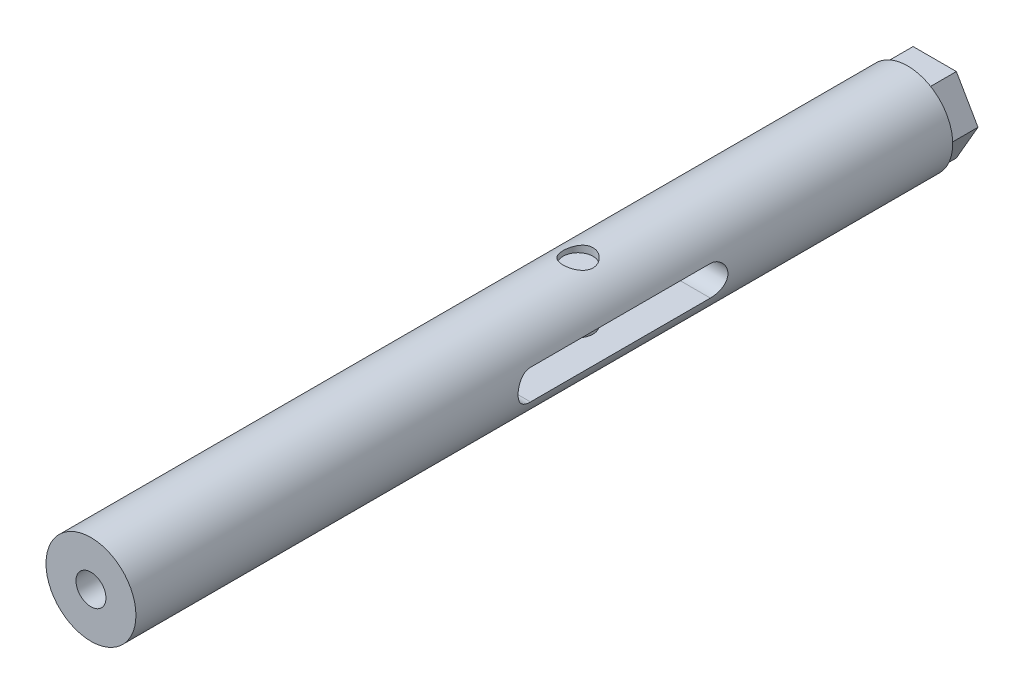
ISO-10303-21;
HEADER;
FILE_DESCRIPTION(('STEP AP214'),'2;1');
FILE_NAME('part.step','',(''),(''),'','','');
FILE_SCHEMA(('AUTOMOTIVE_DESIGN { 1 0 10303 214 1 1 1 1 }'));
ENDSEC;
DATA;
#1=APPLICATION_CONTEXT('core data for automotive mechanical design processes');
#2=APPLICATION_PROTOCOL_DEFINITION('international standard','automotive_design',2000,#1);
#3=PRODUCT_CONTEXT('',#1,'mechanical');
#4=PRODUCT('Part','Part','',(#3));
#5=PRODUCT_RELATED_PRODUCT_CATEGORY('part','',(#4));
#6=PRODUCT_DEFINITION_FORMATION('','',#4);
#7=PRODUCT_DEFINITION_CONTEXT('part definition',#1,'design');
#8=PRODUCT_DEFINITION('design','',#6,#7);
#9=PRODUCT_DEFINITION_SHAPE('','',#8);
#10=(LENGTH_UNIT() NAMED_UNIT(*) SI_UNIT(.MILLI.,.METRE.));
#11=(NAMED_UNIT(*) PLANE_ANGLE_UNIT() SI_UNIT($,.RADIAN.));
#12=(NAMED_UNIT(*) SI_UNIT($,.STERADIAN.) SOLID_ANGLE_UNIT());
#13=UNCERTAINTY_MEASURE_WITH_UNIT(LENGTH_MEASURE(1.E-05),#10,'distance_accuracy_value','');
#14=(GEOMETRIC_REPRESENTATION_CONTEXT(3) GLOBAL_UNCERTAINTY_ASSIGNED_CONTEXT((#13)) GLOBAL_UNIT_ASSIGNED_CONTEXT((#10,
#11,#12)) REPRESENTATION_CONTEXT('',''));
#15=CARTESIAN_POINT('',(0.,0.,0.));
#16=DIRECTION('',(0.,0.,1.));
#17=DIRECTION('',(1.,0.,0.));
#18=AXIS2_PLACEMENT_3D('',#15,#16,#17);
#19=CARTESIAN_POINT('',(0.,-5.,47.6));
#20=DIRECTION('',(0.,1.,0.));
#21=DIRECTION('',(-0.955367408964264,0.,-0.295420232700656));
#22=AXIS2_PLACEMENT_3D('',#19,#20,#21);
#23=PLANE('',#22);
#24=CARTESIAN_POINT('',(0.,-5.,47.6));
#25=DIRECTION('',(0.,1.,0.));
#26=DIRECTION('',(-0.955367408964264,0.,-0.295420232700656));
#27=AXIS2_PLACEMENT_3D('',#24,#25,#26);
#28=CIRCLE('',#27,2.);
#29=CARTESIAN_POINT('',(-1.91073481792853,-5.,47.0091595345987));
#30=VERTEX_POINT('',#29);
#31=EDGE_CURVE('E255',#30,#30,#28,.T.);
#32=ORIENTED_EDGE('',*,*,#31,.F.);
#33=EDGE_LOOP('',(#32));
#34=FACE_BOUND('',#33,.T.);
#35=ADVANCED_FACE('F14',(#34),#23,.F.);
#36=CARTESIAN_POINT('',(0.,5.,47.6));
#37=DIRECTION('',(0.,-1.,0.));
#38=DIRECTION('',(0.955367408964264,0.,0.295420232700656));
#39=AXIS2_PLACEMENT_3D('',#36,#37,#38);
#40=CYLINDRICAL_SURFACE('',#39,2.);
#41=CARTESIAN_POINT('',(0.,-2.,47.6));
#42=DIRECTION('',(0.,-1.,0.));
#43=DIRECTION('',(-1.,0.,0.));
#44=AXIS2_PLACEMENT_3D('',#41,#42,#43);
#45=CIRCLE('',#44,2.);
#46=CARTESIAN_POINT('',(-2.,-2.,47.6));
#47=VERTEX_POINT('',#46);
#48=EDGE_CURVE('E24',#47,#47,#45,.T.);
#49=ORIENTED_EDGE('',*,*,#48,.F.);
#50=EDGE_LOOP('',(#49));
#51=FACE_BOUND('',#50,.T.);
#52=CARTESIAN_POINT('',(0.,2.,47.6));
#53=DIRECTION('',(0.,1.,0.));
#54=DIRECTION('',(1.,0.,0.));
#55=AXIS2_PLACEMENT_3D('',#52,#53,#54);
#56=CIRCLE('',#55,2.);
#57=CARTESIAN_POINT('',(2.,2.,47.6));
#58=VERTEX_POINT('',#57);
#59=EDGE_CURVE('E9',#58,#58,#56,.T.);
#60=ORIENTED_EDGE('',*,*,#59,.F.);
#61=EDGE_LOOP('',(#60));
#62=FACE_BOUND('',#61,.T.);
#63=ADVANCED_FACE('F214',(#51,#62),#40,.T.);
#64=CARTESIAN_POINT('',(0.,5.,47.6));
#65=DIRECTION('',(0.,1.,0.));
#66=DIRECTION('',(-0.955367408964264,0.,-0.295420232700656));
#67=AXIS2_PLACEMENT_3D('',#64,#65,#66);
#68=PLANE('',#67);
#69=CARTESIAN_POINT('',(0.,5.,47.6));
#70=DIRECTION('',(0.,1.,0.));
#71=DIRECTION('',(-0.955367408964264,0.,-0.295420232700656));
#72=AXIS2_PLACEMENT_3D('',#69,#70,#71);
#73=CIRCLE('',#72,2.);
#74=CARTESIAN_POINT('',(-1.91073481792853,5.,47.0091595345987));
#75=VERTEX_POINT('',#74);
#76=EDGE_CURVE('E253',#75,#75,#73,.T.);
#77=ORIENTED_EDGE('',*,*,#76,.T.);
#78=EDGE_LOOP('',(#77));
#79=FACE_BOUND('',#78,.T.);
#80=ADVANCED_FACE('F217',(#79),#68,.T.);
#81=CARTESIAN_POINT('',(0.,0.,18.6));
#82=DIRECTION('',(0.,0.,-1.));
#83=DIRECTION('',(0.,1.,0.));
#84=AXIS2_PLACEMENT_3D('',#81,#82,#83);
#85=CONICAL_SURFACE('',#84,3.,1.02974425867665);
#86=CARTESIAN_POINT('',(0.,0.,20.4025818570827));
#87=VERTEX_POINT('',#86);
#88=VERTEX_LOOP('',#87);
#89=FACE_BOUND('',#88,.T.);
#90=CARTESIAN_POINT('',(0.,0.,18.6));
#91=DIRECTION('',(0.,0.,-1.));
#92=DIRECTION('',(0.,1.,0.));
#93=AXIS2_PLACEMENT_3D('',#90,#91,#92);
#94=CIRCLE('',#93,3.);
#95=CARTESIAN_POINT('',(0.,3.,18.6));
#96=VERTEX_POINT('',#95);
#97=EDGE_CURVE('E142',#96,#96,#94,.T.);
#98=ORIENTED_EDGE('',*,*,#97,.T.);
#99=EDGE_LOOP('',(#98));
#100=FACE_BOUND('',#99,.T.);
#101=ADVANCED_FACE('F194',(#89,#100),#85,.F.);
#102=CARTESIAN_POINT('',(0.,0.,3.6));
#103=DIRECTION('',(0.,0.,-1.));
#104=DIRECTION('',(0.,1.,0.));
#105=AXIS2_PLACEMENT_3D('',#102,#103,#104);
#106=CYLINDRICAL_SURFACE('',#105,3.);
#107=ORIENTED_EDGE('',*,*,#97,.F.);
#108=EDGE_LOOP('',(#107));
#109=FACE_BOUND('',#108,.T.);
#110=CARTESIAN_POINT('',(0.,0.,0.));
#111=DIRECTION('',(0.,0.,1.));
#112=DIRECTION('',(-0.5,-0.86602540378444,0.));
#113=AXIS2_PLACEMENT_3D('',#110,#111,#112);
#114=CIRCLE('',#113,3.);
#115=CARTESIAN_POINT('',(-1.5,-2.59807621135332,0.));
#116=VERTEX_POINT('',#115);
#117=EDGE_CURVE('E18',#116,#116,#114,.F.);
#118=ORIENTED_EDGE('',*,*,#117,.T.);
#119=EDGE_LOOP('',(#118));
#120=FACE_BOUND('',#119,.T.);
#121=ADVANCED_FACE('F231',(#109,#120),#106,.F.);
#122=CARTESIAN_POINT('',(-11.7435941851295,-0.340501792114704,0.));
#123=DIRECTION('',(0.,0.,1.));
#124=DIRECTION('',(-0.5,-0.86602540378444,0.));
#125=AXIS2_PLACEMENT_3D('',#122,#123,#124);
#126=PLANE('',#125);
#127=DIRECTION('',(-0.5,-0.86602540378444,0.));
#128=VECTOR('',#127,1.);
#129=CARTESIAN_POINT('',(2.88675134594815,-5.,0.));
#130=LINE('',#129,#128);
#131=CARTESIAN_POINT('',(5.77350269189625,0.,0.));
#132=VERTEX_POINT('',#131);
#133=CARTESIAN_POINT('',(2.88675134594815,-5.,0.));
#134=VERTEX_POINT('',#133);
#135=EDGE_CURVE('E54',#132,#134,#130,.T.);
#136=ORIENTED_EDGE('',*,*,#135,.T.);
#137=DIRECTION('',(1.,0.,0.));
#138=VECTOR('',#137,1.);
#139=CARTESIAN_POINT('',(2.88675134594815,-5.,0.));
#140=LINE('',#139,#138);
#141=CARTESIAN_POINT('',(-2.8867513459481,-5.,0.));
#142=VERTEX_POINT('',#141);
#143=EDGE_CURVE('E442',#142,#134,#140,.T.);
#144=ORIENTED_EDGE('',*,*,#143,.F.);
#145=DIRECTION('',(-0.5,0.866025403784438,0.));
#146=VECTOR('',#145,1.);
#147=CARTESIAN_POINT('',(-5.77350269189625,0.,0.));
#148=LINE('',#147,#146);
#149=CARTESIAN_POINT('',(-5.77350269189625,0.,0.));
#150=VERTEX_POINT('',#149);
#151=EDGE_CURVE('E444',#142,#150,#148,.T.);
#152=ORIENTED_EDGE('',*,*,#151,.T.);
#153=DIRECTION('',(-0.5,-0.86602540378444,0.));
#154=VECTOR('',#153,1.);
#155=CARTESIAN_POINT('',(-5.77350269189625,0.,0.));
#156=LINE('',#155,#154);
#157=CARTESIAN_POINT('',(-2.88675134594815,5.,0.));
#158=VERTEX_POINT('',#157);
#159=EDGE_CURVE('E445',#158,#150,#156,.T.);
#160=ORIENTED_EDGE('',*,*,#159,.F.);
#161=DIRECTION('',(-1.,0.,0.));
#162=VECTOR('',#161,1.);
#163=CARTESIAN_POINT('',(-2.88675134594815,5.,0.));
#164=LINE('',#163,#162);
#165=CARTESIAN_POINT('',(2.88675134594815,5.,0.));
#166=VERTEX_POINT('',#165);
#167=EDGE_CURVE('E59',#166,#158,#164,.T.);
#168=ORIENTED_EDGE('',*,*,#167,.F.);
#169=DIRECTION('',(0.5,-0.866025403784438,0.));
#170=VECTOR('',#169,1.);
#171=CARTESIAN_POINT('',(5.77350269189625,0.,0.));
#172=LINE('',#171,#170);
#173=EDGE_CURVE('E249',#166,#132,#172,.T.);
#174=ORIENTED_EDGE('',*,*,#173,.T.);
#175=EDGE_LOOP('',(#136,#144,#152,#160,#168,#174));
#176=FACE_BOUND('',#175,.T.);
#177=ORIENTED_EDGE('',*,*,#117,.F.);
#178=EDGE_LOOP('',(#177));
#179=FACE_BOUND('',#178,.T.);
#180=ADVANCED_FACE('F314',(#176,#179),#126,.F.);
#181=CARTESIAN_POINT('',(-5.77350269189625,0.,-1.4));
#182=DIRECTION('',(-0.866025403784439,-0.5,0.));
#183=DIRECTION('',(-0.5,0.866025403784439,0.));
#184=AXIS2_PLACEMENT_3D('',#181,#182,#183);
#185=PLANE('',#184);
#186=ORIENTED_EDGE('',*,*,#151,.F.);
#187=DIRECTION('',(0.,0.,1.));
#188=VECTOR('',#187,1.);
#189=CARTESIAN_POINT('',(-2.8867513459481,-5.,-1.4));
#190=LINE('',#189,#188);
#191=CARTESIAN_POINT('',(-2.8867513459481,-5.,3.6));
#192=VERTEX_POINT('',#191);
#193=EDGE_CURVE('E123',#142,#192,#190,.T.);
#194=ORIENTED_EDGE('',*,*,#193,.T.);
#195=DIRECTION('',(0.5,-0.866025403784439,0.));
#196=VECTOR('',#195,1.);
#197=CARTESIAN_POINT('',(-5.77350269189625,0.,3.6));
#198=LINE('',#197,#196);
#199=CARTESIAN_POINT('',(-5.77350269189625,0.,3.6));
#200=VERTEX_POINT('',#199);
#201=EDGE_CURVE('E118',#200,#192,#198,.T.);
#202=ORIENTED_EDGE('',*,*,#201,.F.);
#203=DIRECTION('',(0.,0.,1.));
#204=VECTOR('',#203,1.);
#205=CARTESIAN_POINT('',(-5.77350269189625,0.,-1.4));
#206=LINE('',#205,#204);
#207=EDGE_CURVE('E117',#150,#200,#206,.T.);
#208=ORIENTED_EDGE('',*,*,#207,.F.);
#209=EDGE_LOOP('',(#186,#194,#202,#208));
#210=FACE_BOUND('',#209,.T.);
#211=ADVANCED_FACE('F322',(#210),#185,.T.);
#212=CARTESIAN_POINT('',(-5.77350269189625,0.,-1.4));
#213=DIRECTION('',(0.86602540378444,-0.5,0.));
#214=DIRECTION('',(0.,0.,-1.));
#215=AXIS2_PLACEMENT_3D('',#212,#213,#214);
#216=PLANE('',#215);
#217=DIRECTION('',(0.,0.,1.));
#218=VECTOR('',#217,1.);
#219=CARTESIAN_POINT('',(-2.88675134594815,5.,-1.4));
#220=LINE('',#219,#218);
#221=CARTESIAN_POINT('',(-2.88675134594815,5.,3.6));
#222=VERTEX_POINT('',#221);
#223=EDGE_CURVE('E115',#158,#222,#220,.T.);
#224=ORIENTED_EDGE('',*,*,#223,.F.);
#225=ORIENTED_EDGE('',*,*,#159,.T.);
#226=ORIENTED_EDGE('',*,*,#207,.T.);
#227=DIRECTION('',(0.5,0.86602540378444,0.));
#228=VECTOR('',#227,1.);
#229=CARTESIAN_POINT('',(-5.77350269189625,0.,3.6));
#230=LINE('',#229,#228);
#231=EDGE_CURVE('E104',#200,#222,#230,.T.);
#232=ORIENTED_EDGE('',*,*,#231,.T.);
#233=EDGE_LOOP('',(#224,#225,#226,#232));
#234=FACE_BOUND('',#233,.T.);
#235=ADVANCED_FACE('F113',(#234),#216,.F.);
#236=CARTESIAN_POINT('',(-2.88675134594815,5.,-1.4));
#237=DIRECTION('',(0.,-1.,0.));
#238=DIRECTION('',(-1.,0.,0.));
#239=AXIS2_PLACEMENT_3D('',#236,#237,#238);
#240=PLANE('',#239);
#241=DIRECTION('',(0.,0.,1.));
#242=VECTOR('',#241,1.);
#243=CARTESIAN_POINT('',(2.88675134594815,5.,-1.4));
#244=LINE('',#243,#242);
#245=CARTESIAN_POINT('',(2.88675134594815,5.,3.6));
#246=VERTEX_POINT('',#245);
#247=EDGE_CURVE('E121',#166,#246,#244,.T.);
#248=ORIENTED_EDGE('',*,*,#247,.F.);
#249=ORIENTED_EDGE('',*,*,#167,.T.);
#250=ORIENTED_EDGE('',*,*,#223,.T.);
#251=DIRECTION('',(1.,0.,0.));
#252=VECTOR('',#251,1.);
#253=CARTESIAN_POINT('',(-2.88675134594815,5.,3.6));
#254=LINE('',#253,#252);
#255=EDGE_CURVE('E100',#222,#246,#254,.T.);
#256=ORIENTED_EDGE('',*,*,#255,.T.);
#257=EDGE_LOOP('',(#248,#249,#250,#256));
#258=FACE_BOUND('',#257,.T.);
#259=ADVANCED_FACE('F120',(#258),#240,.F.);
#260=CARTESIAN_POINT('',(5.77350269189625,0.,-1.4));
#261=DIRECTION('',(0.866025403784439,0.5,0.));
#262=DIRECTION('',(0.5,-0.866025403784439,0.));
#263=AXIS2_PLACEMENT_3D('',#260,#261,#262);
#264=PLANE('',#263);
#265=ORIENTED_EDGE('',*,*,#173,.F.);
#266=ORIENTED_EDGE('',*,*,#247,.T.);
#267=DIRECTION('',(-0.5,0.866025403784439,0.));
#268=VECTOR('',#267,1.);
#269=CARTESIAN_POINT('',(5.77350269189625,0.,3.6));
#270=LINE('',#269,#268);
#271=CARTESIAN_POINT('',(5.77350269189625,0.,3.6));
#272=VERTEX_POINT('',#271);
#273=EDGE_CURVE('E33',#272,#246,#270,.T.);
#274=ORIENTED_EDGE('',*,*,#273,.F.);
#275=DIRECTION('',(0.,0.,1.));
#276=VECTOR('',#275,1.);
#277=CARTESIAN_POINT('',(5.77350269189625,0.,-1.4));
#278=LINE('',#277,#276);
#279=EDGE_CURVE('E125',#132,#272,#278,.T.);
#280=ORIENTED_EDGE('',*,*,#279,.F.);
#281=EDGE_LOOP('',(#265,#266,#274,#280));
#282=FACE_BOUND('',#281,.T.);
#283=ADVANCED_FACE('F324',(#282),#264,.T.);
#284=CARTESIAN_POINT('',(2.88675134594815,-5.,-1.4));
#285=DIRECTION('',(0.86602540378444,-0.5,0.));
#286=DIRECTION('',(0.,0.,-1.));
#287=AXIS2_PLACEMENT_3D('',#284,#285,#286);
#288=PLANE('',#287);
#289=ORIENTED_EDGE('',*,*,#135,.F.);
#290=ORIENTED_EDGE('',*,*,#279,.T.);
#291=DIRECTION('',(0.5,0.86602540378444,0.));
#292=VECTOR('',#291,1.);
#293=CARTESIAN_POINT('',(2.88675134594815,-5.,3.6));
#294=LINE('',#293,#292);
#295=CARTESIAN_POINT('',(2.88675134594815,-5.,3.6));
#296=VERTEX_POINT('',#295);
#297=EDGE_CURVE('E257',#296,#272,#294,.T.);
#298=ORIENTED_EDGE('',*,*,#297,.F.);
#299=DIRECTION('',(0.,0.,1.));
#300=VECTOR('',#299,1.);
#301=CARTESIAN_POINT('',(2.88675134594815,-5.,-1.4));
#302=LINE('',#301,#300);
#303=EDGE_CURVE('E130',#134,#296,#302,.T.);
#304=ORIENTED_EDGE('',*,*,#303,.F.);
#305=EDGE_LOOP('',(#289,#290,#298,#304));
#306=FACE_BOUND('',#305,.T.);
#307=ADVANCED_FACE('F331',(#306),#288,.T.);
#308=CARTESIAN_POINT('',(2.88675134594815,-5.,-1.4));
#309=DIRECTION('',(0.,1.,0.));
#310=DIRECTION('',(1.,0.,0.));
#311=AXIS2_PLACEMENT_3D('',#308,#309,#310);
#312=PLANE('',#311);
#313=ORIENTED_EDGE('',*,*,#193,.F.);
#314=ORIENTED_EDGE('',*,*,#143,.T.);
#315=ORIENTED_EDGE('',*,*,#303,.T.);
#316=DIRECTION('',(-1.,0.,0.));
#317=VECTOR('',#316,1.);
#318=CARTESIAN_POINT('',(2.88675134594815,-5.,3.6));
#319=LINE('',#318,#317);
#320=EDGE_CURVE('E282',#296,#192,#319,.T.);
#321=ORIENTED_EDGE('',*,*,#320,.T.);
#322=EDGE_LOOP('',(#313,#314,#315,#321));
#323=FACE_BOUND('',#322,.T.);
#324=ADVANCED_FACE('F16',(#323),#312,.F.);
#325=CARTESIAN_POINT('',(0.,0.,3.6));
#326=DIRECTION('',(0.,0.,1.));
#327=DIRECTION('',(0.,-1.,0.));
#328=AXIS2_PLACEMENT_3D('',#325,#326,#327);
#329=PLANE('',#328);
#330=ORIENTED_EDGE('',*,*,#320,.F.);
#331=ORIENTED_EDGE('',*,*,#297,.T.);
#332=ORIENTED_EDGE('',*,*,#273,.T.);
#333=ORIENTED_EDGE('',*,*,#255,.F.);
#334=ORIENTED_EDGE('',*,*,#231,.F.);
#335=ORIENTED_EDGE('',*,*,#201,.T.);
#336=EDGE_LOOP('',(#330,#331,#332,#333,#334,#335));
#337=FACE_BOUND('',#336,.T.);
#338=CARTESIAN_POINT('',(0.,0.,3.6));
#339=DIRECTION('',(0.,0.,-1.));
#340=DIRECTION('',(0.,1.,0.));
#341=AXIS2_PLACEMENT_3D('',#338,#339,#340);
#342=CIRCLE('',#341,6.);
#343=CARTESIAN_POINT('',(0.,6.,3.6));
#344=VERTEX_POINT('',#343);
#345=EDGE_CURVE('E137',#344,#344,#342,.T.);
#346=ORIENTED_EDGE('',*,*,#345,.T.);
#347=EDGE_LOOP('',(#346));
#348=FACE_BOUND('',#347,.T.);
#349=ADVANCED_FACE('F102',(#337,#348),#329,.F.);
#350=CARTESIAN_POINT('',(0.,0.,112.6));
#351=DIRECTION('',(0.,0.,-1.));
#352=DIRECTION('',(0.,1.,0.));
#353=AXIS2_PLACEMENT_3D('',#350,#351,#352);
#354=PLANE('',#353);
#355=CARTESIAN_POINT('',(0.,0.,112.6));
#356=DIRECTION('',(0.,0.,1.));
#357=DIRECTION('',(1.,0.,0.));
#358=AXIS2_PLACEMENT_3D('',#355,#356,#357);
#359=CIRCLE('',#358,2.);
#360=CARTESIAN_POINT('',(2.,0.,112.6));
#361=VERTEX_POINT('',#360);
#362=EDGE_CURVE('E246',#361,#361,#359,.T.);
#363=ORIENTED_EDGE('',*,*,#362,.F.);
#364=EDGE_LOOP('',(#363));
#365=FACE_BOUND('',#364,.T.);
#366=CARTESIAN_POINT('',(0.,0.,112.6));
#367=DIRECTION('',(0.,0.,1.));
#368=DIRECTION('',(0.,-1.,0.));
#369=AXIS2_PLACEMENT_3D('',#366,#367,#368);
#370=CIRCLE('',#369,6.);
#371=CARTESIAN_POINT('',(0.,-6.,112.6));
#372=VERTEX_POINT('',#371);
#373=EDGE_CURVE('E132',#372,#372,#370,.T.);
#374=ORIENTED_EDGE('',*,*,#373,.T.);
#375=EDGE_LOOP('',(#374));
#376=FACE_BOUND('',#375,.T.);
#377=ADVANCED_FACE('F198',(#365,#376),#354,.F.);
#378=CARTESIAN_POINT('',(-10.,0.,35.6));
#379=DIRECTION('',(1.,0.,0.));
#380=DIRECTION('',(0.,1.,0.));
#381=AXIS2_PLACEMENT_3D('',#378,#379,#380);
#382=CYLINDRICAL_SURFACE('',#381,2.);
#383=DIRECTION('',(1.,0.,0.));
#384=VECTOR('',#383,1.);
#385=CARTESIAN_POINT('',(-10.,2.,35.6));
#386=LINE('',#385,#384);
#387=CARTESIAN_POINT('',(-5.6568542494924,2.,35.6));
#388=VERTEX_POINT('',#387);
#389=CARTESIAN_POINT('',(5.6568542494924,2.,35.6));
#390=VERTEX_POINT('',#389);
#391=EDGE_CURVE('E153',#388,#390,#386,.T.);
#392=ORIENTED_EDGE('',*,*,#391,.F.);
#393=CARTESIAN_POINT('',(-5.6568542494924,-2.,35.6));
#394=CARTESIAN_POINT('',(-5.65684884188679,-2.0000014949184,35.5454190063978));
#395=CARTESIAN_POINT('',(-5.6576451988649,-1.99776424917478,35.4908658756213));
#396=CARTESIAN_POINT('',(-5.66078654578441,-1.9888512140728,35.3821828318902));
#397=CARTESIAN_POINT('',(-5.66313111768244,-1.98217662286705,35.3280528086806));
#398=CARTESIAN_POINT('',(-5.67238184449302,-1.95562135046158,35.1672157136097));
#399=CARTESIAN_POINT('',(-5.68150584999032,-1.92920846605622,35.0616383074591));
#400=CARTESIAN_POINT('',(-5.70456149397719,-1.85991682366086,34.8567496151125));
#401=CARTESIAN_POINT('',(-5.71849047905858,-1.81704715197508,34.7574349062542));
#402=CARTESIAN_POINT('',(-5.74957574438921,-1.71614645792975,34.5673203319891));
#403=CARTESIAN_POINT('',(-5.76673400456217,-1.65810612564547,34.4765257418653));
#404=CARTESIAN_POINT('',(-5.80308960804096,-1.52610278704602,34.302559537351));
#405=CARTESIAN_POINT('',(-5.82233755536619,-1.45164996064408,34.2197702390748));
#406=CARTESIAN_POINT('',(-5.86027697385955,-1.28997688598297,34.0675879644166));
#407=CARTESIAN_POINT('',(-5.87896834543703,-1.20275436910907,33.9981973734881));
#408=CARTESIAN_POINT('',(-5.91427765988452,-1.01520729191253,33.8730409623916));
#409=CARTESIAN_POINT('',(-5.93082875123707,-0.914600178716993,33.8176780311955));
#410=CARTESIAN_POINT('',(-5.95939217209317,-0.704858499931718,33.7248154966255));
#411=CARTESIAN_POINT('',(-5.97140588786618,-0.595726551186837,33.6873104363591));
#412=CARTESIAN_POINT('',(-5.98918142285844,-0.37605869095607,33.6325285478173));
#413=CARTESIAN_POINT('',(-5.99514617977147,-0.265703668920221,33.6145934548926));
#414=CARTESIAN_POINT('',(-6.00087216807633,-0.043397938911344,33.5973674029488));
#415=CARTESIAN_POINT('',(-6.00063487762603,0.0685523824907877,33.5980720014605));
#416=CARTESIAN_POINT('',(-5.9941207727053,0.286207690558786,33.6176885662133));
#417=CARTESIAN_POINT('',(-5.98808121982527,0.391985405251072,33.6358852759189));
#418=CARTESIAN_POINT('',(-5.97093921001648,0.598888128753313,33.6887863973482));
#419=CARTESIAN_POINT('',(-5.95983647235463,0.700012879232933,33.7234917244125));
#420=CARTESIAN_POINT('',(-5.93351336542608,0.896305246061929,33.8088427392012));
#421=CARTESIAN_POINT('',(-5.91824075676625,0.991377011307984,33.8596920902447));
#422=CARTESIAN_POINT('',(-5.88516775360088,1.17184917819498,33.9757199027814));
#423=CARTESIAN_POINT('',(-5.86736667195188,1.25724693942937,34.040902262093));
#424=CARTESIAN_POINT('',(-5.83012543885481,1.42019467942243,34.1873420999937));
#425=CARTESIAN_POINT('',(-5.81064757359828,1.4971872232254,34.2692110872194));
#426=CARTESIAN_POINT('',(-5.77294980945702,1.63654404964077,34.4448829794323));
#427=CARTESIAN_POINT('',(-5.75473031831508,1.69890360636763,34.5386897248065));
#428=CARTESIAN_POINT('',(-5.72140062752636,1.80800665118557,34.7373603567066));
#429=CARTESIAN_POINT('',(-5.70634029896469,1.85450601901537,34.8423670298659));
#430=CARTESIAN_POINT('',(-5.68162194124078,1.92892046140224,35.0592939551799));
#431=CARTESIAN_POINT('',(-5.67195538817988,1.95686487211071,35.1712029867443));
#432=CARTESIAN_POINT('',(-5.66273084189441,1.98331631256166,35.336837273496));
#433=CARTESIAN_POINT('',(-5.66053335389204,1.98957012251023,35.3892827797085));
#434=CARTESIAN_POINT('',(-5.65759407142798,1.9979092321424,35.4944761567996));
#435=CARTESIAN_POINT('',(-5.65685039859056,1.99999991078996,35.5472235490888));
#436=CARTESIAN_POINT('',(-5.6568542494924,2.,35.6));
#437=B_SPLINE_CURVE_WITH_KNOTS('',3,(#393,#394,#395,#396,#397,#398,#399,#400,#401,#402,#403,
#404,#405,#406,#407,#408,#409,#410,#411,#412,#413,#414,#415,#416,#417,#418,#419,#420,#421,#422,
#423,#424,#425,#426,#427,#428,#429,#430,#431,#432,#433,#434,#435,#436),.UNSPECIFIED.,.F.,.F.,(4,
2,2,2,2,2,2,2,2,2,2,2,2,2,2,2,2,2,2,2,2,4),(0.,0.163636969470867,0.327229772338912,
0.653162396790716,0.978915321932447,1.3048686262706,1.64233009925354,1.97985159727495,
2.32618265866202,2.67240782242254,3.00658941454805,3.34069136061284,3.6616883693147,
3.98270317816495,4.30794037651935,4.63326613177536,4.973881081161,5.31460588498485,
5.66036059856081,6.0055673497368,6.16399790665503,6.32222363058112),.UNSPECIFIED.);
#438=CARTESIAN_POINT('',(-5.6568542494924,-2.,35.6));
#439=VERTEX_POINT('',#438);
#440=EDGE_CURVE('E279',#439,#388,#437,.T.);
#441=ORIENTED_EDGE('',*,*,#440,.F.);
#442=DIRECTION('',(1.,0.,0.));
#443=VECTOR('',#442,1.);
#444=CARTESIAN_POINT('',(-10.,-2.,35.6));
#445=LINE('',#444,#443);
#446=CARTESIAN_POINT('',(5.6568542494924,-2.,35.6));
#447=VERTEX_POINT('',#446);
#448=EDGE_CURVE('E156',#439,#447,#445,.T.);
#449=ORIENTED_EDGE('',*,*,#448,.T.);
#450=CARTESIAN_POINT('',(5.6568542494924,2.,35.6));
#451=CARTESIAN_POINT('',(5.65684884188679,2.0000014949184,35.5454190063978));
#452=CARTESIAN_POINT('',(5.6576451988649,1.99776424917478,35.4908658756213));
#453=CARTESIAN_POINT('',(5.66078654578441,1.9888512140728,35.3821828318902));
#454=CARTESIAN_POINT('',(5.66313111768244,1.98217662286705,35.3280528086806));
#455=CARTESIAN_POINT('',(5.67238184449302,1.95562135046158,35.1672157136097));
#456=CARTESIAN_POINT('',(5.68150584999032,1.92920846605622,35.0616383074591));
#457=CARTESIAN_POINT('',(5.70456149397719,1.85991682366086,34.8567496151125));
#458=CARTESIAN_POINT('',(5.71849047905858,1.81704715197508,34.7574349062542));
#459=CARTESIAN_POINT('',(5.74957574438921,1.71614645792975,34.5673203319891));
#460=CARTESIAN_POINT('',(5.76673400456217,1.65810612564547,34.4765257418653));
#461=CARTESIAN_POINT('',(5.80308960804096,1.52610278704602,34.302559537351));
#462=CARTESIAN_POINT('',(5.82233755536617,1.45164996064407,34.2197702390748));
#463=CARTESIAN_POINT('',(5.86027697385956,1.28997688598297,34.0675879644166));
#464=CARTESIAN_POINT('',(5.87896834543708,1.20275436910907,33.9981973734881));
#465=CARTESIAN_POINT('',(5.91427765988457,1.01520729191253,33.8730409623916));
#466=CARTESIAN_POINT('',(5.93082875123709,0.91460017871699,33.8176780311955));
#467=CARTESIAN_POINT('',(5.95939217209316,0.704858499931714,33.7248154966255));
#468=CARTESIAN_POINT('',(5.97140588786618,0.595726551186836,33.6873104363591));
#469=CARTESIAN_POINT('',(5.98918142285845,0.37605869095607,33.6325285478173));
#470=CARTESIAN_POINT('',(5.99514617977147,0.265703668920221,33.6145934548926));
#471=CARTESIAN_POINT('',(6.00087216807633,0.0433979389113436,33.5973674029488));
#472=CARTESIAN_POINT('',(6.00063487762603,-0.0685523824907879,33.5980720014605));
#473=CARTESIAN_POINT('',(5.9941207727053,-0.286207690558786,33.6176885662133));
#474=CARTESIAN_POINT('',(5.98808121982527,-0.391985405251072,33.6358852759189));
#475=CARTESIAN_POINT('',(5.97093921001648,-0.598888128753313,33.6887863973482));
#476=CARTESIAN_POINT('',(5.95983647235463,-0.700012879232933,33.7234917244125));
#477=CARTESIAN_POINT('',(5.93351336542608,-0.896305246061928,33.8088427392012));
#478=CARTESIAN_POINT('',(5.91824075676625,-0.991377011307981,33.8596920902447));
#479=CARTESIAN_POINT('',(5.88516775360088,-1.17184917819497,33.9757199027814));
#480=CARTESIAN_POINT('',(5.86736667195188,-1.25724693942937,34.040902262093));
#481=CARTESIAN_POINT('',(5.83012543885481,-1.42019467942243,34.1873420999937));
#482=CARTESIAN_POINT('',(5.81064757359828,-1.4971872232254,34.2692110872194));
#483=CARTESIAN_POINT('',(5.77294980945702,-1.63654404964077,34.4448829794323));
#484=CARTESIAN_POINT('',(5.75473031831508,-1.69890360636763,34.5386897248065));
#485=CARTESIAN_POINT('',(5.72140062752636,-1.80800665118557,34.7373603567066));
#486=CARTESIAN_POINT('',(5.70634029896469,-1.85450601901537,34.8423670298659));
#487=CARTESIAN_POINT('',(5.68162194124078,-1.92892046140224,35.0592939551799));
#488=CARTESIAN_POINT('',(5.67195538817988,-1.95686487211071,35.1712029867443));
#489=CARTESIAN_POINT('',(5.66273084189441,-1.98331631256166,35.336837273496));
#490=CARTESIAN_POINT('',(5.66053335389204,-1.98957012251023,35.3892827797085));
#491=CARTESIAN_POINT('',(5.65759407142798,-1.9979092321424,35.4944761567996));
#492=CARTESIAN_POINT('',(5.65685039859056,-1.99999991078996,35.5472235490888));
#493=CARTESIAN_POINT('',(5.6568542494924,-2.,35.6));
#494=B_SPLINE_CURVE_WITH_KNOTS('',3,(#450,#451,#452,#453,#454,#455,#456,#457,#458,#459,#460,
#461,#462,#463,#464,#465,#466,#467,#468,#469,#470,#471,#472,#473,#474,#475,#476,#477,#478,#479,
#480,#481,#482,#483,#484,#485,#486,#487,#488,#489,#490,#491,#492,#493),.UNSPECIFIED.,.F.,.F.,(4,
2,2,2,2,2,2,2,2,2,2,2,2,2,2,2,2,2,2,2,2,4),(0.,0.163636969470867,0.327229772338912,
0.653162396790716,0.978915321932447,1.3048686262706,1.64233009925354,1.97985159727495,
2.32618265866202,2.67240782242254,3.00658941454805,3.34069136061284,3.6616883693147,
3.98270317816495,4.30794037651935,4.63326613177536,4.973881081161,5.31460588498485,
5.66036059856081,6.0055673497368,6.16399790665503,6.32222363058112),.UNSPECIFIED.);
#495=EDGE_CURVE('E284',#390,#447,#494,.T.);
#496=ORIENTED_EDGE('',*,*,#495,.F.);
#497=EDGE_LOOP('',(#392,#441,#449,#496));
#498=FACE_BOUND('',#497,.T.);
#499=ADVANCED_FACE('F201',(#498),#382,.F.);
#500=CARTESIAN_POINT('',(0.,0.,3.6));
#501=DIRECTION('',(0.,0.,-1.));
#502=DIRECTION('',(0.,1.,0.));
#503=AXIS2_PLACEMENT_3D('',#500,#501,#502);
#504=CYLINDRICAL_SURFACE('',#503,6.);
#505=ORIENTED_EDGE('',*,*,#373,.F.);
#506=EDGE_LOOP('',(#505));
#507=FACE_BOUND('',#506,.T.);
#508=DIRECTION('',(0.,0.,-1.));
#509=VECTOR('',#508,1.);
#510=CARTESIAN_POINT('',(-5.6568542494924,2.,3.6));
#511=LINE('',#510,#509);
#512=CARTESIAN_POINT('',(-5.6568542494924,2.,59.6));
#513=VERTEX_POINT('',#512);
#514=EDGE_CURVE('E165',#388,#513,#511,.F.);
#515=ORIENTED_EDGE('',*,*,#514,.T.);
#516=CARTESIAN_POINT('',(-5.6568542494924,2.,59.6));
#517=CARTESIAN_POINT('',(-5.65684884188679,2.0000014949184,59.6545809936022));
#518=CARTESIAN_POINT('',(-5.6576451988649,1.99776424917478,59.7091341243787));
#519=CARTESIAN_POINT('',(-5.66078654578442,1.9888512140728,59.8178171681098));
#520=CARTESIAN_POINT('',(-5.66313111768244,1.98217662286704,59.8719471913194));
#521=CARTESIAN_POINT('',(-5.67238184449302,1.95562135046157,60.0327842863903));
#522=CARTESIAN_POINT('',(-5.68150584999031,1.92920846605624,60.138361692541));
#523=CARTESIAN_POINT('',(-5.70456149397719,1.85991682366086,60.3432503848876));
#524=CARTESIAN_POINT('',(-5.71849047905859,1.81704715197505,60.4425650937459));
#525=CARTESIAN_POINT('',(-5.74957574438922,1.71614645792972,60.6326796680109));
#526=CARTESIAN_POINT('',(-5.76673400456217,1.65810612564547,60.7234742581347));
#527=CARTESIAN_POINT('',(-5.80308960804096,1.52610278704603,60.8974404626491));
#528=CARTESIAN_POINT('',(-5.82233755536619,1.45164996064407,60.9802297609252));
#529=CARTESIAN_POINT('',(-5.86027697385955,1.28997688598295,61.1324120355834));
#530=CARTESIAN_POINT('',(-5.87896834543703,1.20275436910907,61.2018026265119));
#531=CARTESIAN_POINT('',(-5.91427765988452,1.01520729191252,61.3269590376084));
#532=CARTESIAN_POINT('',(-5.93082875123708,0.914600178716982,61.3823219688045));
#533=CARTESIAN_POINT('',(-5.95939217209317,0.704858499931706,61.4751845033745));
#534=CARTESIAN_POINT('',(-5.97140588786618,0.595726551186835,61.5126895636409));
#535=CARTESIAN_POINT('',(-5.98918142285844,0.37605869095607,61.5674714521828));
#536=CARTESIAN_POINT('',(-5.99514617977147,0.265703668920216,61.5854065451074));
#537=CARTESIAN_POINT('',(-6.00087216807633,0.0433979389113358,61.6026325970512));
#538=CARTESIAN_POINT('',(-6.00063487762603,-0.0685523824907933,61.6019279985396));
#539=CARTESIAN_POINT('',(-5.9941207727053,-0.286207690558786,61.5823114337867));
#540=CARTESIAN_POINT('',(-5.98808121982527,-0.391985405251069,61.5641147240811));
#541=CARTESIAN_POINT('',(-5.97093921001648,-0.598888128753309,61.5112136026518));
#542=CARTESIAN_POINT('',(-5.95983647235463,-0.700012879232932,61.4765082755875));
#543=CARTESIAN_POINT('',(-5.93351336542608,-0.896305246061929,61.3911572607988));
#544=CARTESIAN_POINT('',(-5.91824075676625,-0.991377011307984,61.3403079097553));
#545=CARTESIAN_POINT('',(-5.88516775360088,-1.17184917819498,61.2242800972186));
#546=CARTESIAN_POINT('',(-5.86736667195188,-1.25724693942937,61.159097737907));
#547=CARTESIAN_POINT('',(-5.83012543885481,-1.42019467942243,61.0126579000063));
#548=CARTESIAN_POINT('',(-5.81064757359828,-1.4971872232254,60.9307889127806));
#549=CARTESIAN_POINT('',(-5.77294980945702,-1.63654404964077,60.7551170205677));
#550=CARTESIAN_POINT('',(-5.75473031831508,-1.69890360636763,60.6613102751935));
#551=CARTESIAN_POINT('',(-5.72140062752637,-1.80800665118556,60.4626396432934));
#552=CARTESIAN_POINT('',(-5.70634029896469,-1.85450601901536,60.3576329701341));
#553=CARTESIAN_POINT('',(-5.68162194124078,-1.92892046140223,60.1407060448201));
#554=CARTESIAN_POINT('',(-5.67195538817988,-1.95686487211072,60.0287970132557));
#555=CARTESIAN_POINT('',(-5.66273084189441,-1.98331631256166,59.8631627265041));
#556=CARTESIAN_POINT('',(-5.66053335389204,-1.98957012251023,59.8107172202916));
#557=CARTESIAN_POINT('',(-5.65759407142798,-1.99790923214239,59.7055238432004));
#558=CARTESIAN_POINT('',(-5.65685039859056,-1.99999991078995,59.6527764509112));
#559=CARTESIAN_POINT('',(-5.6568542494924,-2.,59.6));
#560=B_SPLINE_CURVE_WITH_KNOTS('',3,(#516,#517,#518,#519,#520,#521,#522,#523,#524,#525,#526,
#527,#528,#529,#530,#531,#532,#533,#534,#535,#536,#537,#538,#539,#540,#541,#542,#543,#544,#545,
#546,#547,#548,#549,#550,#551,#552,#553,#554,#555,#556,#557,#558,#559),.UNSPECIFIED.,.F.,.F.,(4,
2,2,2,2,2,2,2,2,2,2,2,2,2,2,2,2,2,2,2,2,4),(0.,0.163636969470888,0.327229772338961,
0.653162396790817,0.978915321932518,1.30486862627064,1.64233009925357,1.97985159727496,
2.32618265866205,2.67240782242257,3.00658941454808,3.34069136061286,3.66168836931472,
3.98270317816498,4.30794037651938,4.63326613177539,4.97388108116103,5.31460588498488,
5.66036059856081,6.00556734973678,6.16399790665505,6.32222363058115),.UNSPECIFIED.);
#561=CARTESIAN_POINT('',(-5.6568542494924,-2.,59.6));
#562=VERTEX_POINT('',#561);
#563=EDGE_CURVE('E277',#513,#562,#560,.T.);
#564=ORIENTED_EDGE('',*,*,#563,.T.);
#565=DIRECTION('',(0.,0.,-1.));
#566=VECTOR('',#565,1.);
#567=CARTESIAN_POINT('',(-5.6568542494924,-2.,3.6));
#568=LINE('',#567,#566);
#569=EDGE_CURVE('E162',#562,#439,#568,.T.);
#570=ORIENTED_EDGE('',*,*,#569,.T.);
#571=ORIENTED_EDGE('',*,*,#440,.T.);
#572=EDGE_LOOP('',(#515,#564,#570,#571));
#573=FACE_BOUND('',#572,.T.);
#574=DIRECTION('',(0.,0.,-1.));
#575=VECTOR('',#574,1.);
#576=CARTESIAN_POINT('',(5.6568542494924,-2.,3.6));
#577=LINE('',#576,#575);
#578=CARTESIAN_POINT('',(5.6568542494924,-2.,59.6));
#579=VERTEX_POINT('',#578);
#580=EDGE_CURVE('E152',#447,#579,#577,.F.);
#581=ORIENTED_EDGE('',*,*,#580,.T.);
#582=CARTESIAN_POINT('',(5.6568542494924,-2.,59.6));
#583=CARTESIAN_POINT('',(5.65684884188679,-2.0000014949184,59.6545809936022));
#584=CARTESIAN_POINT('',(5.6576451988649,-1.99776424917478,59.7091341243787));
#585=CARTESIAN_POINT('',(5.66078654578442,-1.9888512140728,59.8178171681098));
#586=CARTESIAN_POINT('',(5.66313111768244,-1.98217662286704,59.8719471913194));
#587=CARTESIAN_POINT('',(5.67238184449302,-1.95562135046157,60.0327842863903));
#588=CARTESIAN_POINT('',(5.68150584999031,-1.92920846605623,60.138361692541));
#589=CARTESIAN_POINT('',(5.70456149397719,-1.85991682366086,60.3432503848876));
#590=CARTESIAN_POINT('',(5.71849047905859,-1.81704715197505,60.4425650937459));
#591=CARTESIAN_POINT('',(5.74957574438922,-1.71614645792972,60.6326796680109));
#592=CARTESIAN_POINT('',(5.76673400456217,-1.65810612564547,60.7234742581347));
#593=CARTESIAN_POINT('',(5.80308960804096,-1.52610278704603,60.8974404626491));
#594=CARTESIAN_POINT('',(5.82233755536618,-1.45164996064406,60.9802297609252));
#595=CARTESIAN_POINT('',(5.86027697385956,-1.28997688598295,61.1324120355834));
#596=CARTESIAN_POINT('',(5.87896834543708,-1.20275436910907,61.2018026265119));
#597=CARTESIAN_POINT('',(5.91427765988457,-1.01520729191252,61.3269590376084));
#598=CARTESIAN_POINT('',(5.93082875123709,-0.914600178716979,61.3823219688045));
#599=CARTESIAN_POINT('',(5.95939217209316,-0.704858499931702,61.4751845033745));
#600=CARTESIAN_POINT('',(5.97140588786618,-0.595726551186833,61.5126895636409));
#601=CARTESIAN_POINT('',(5.98918142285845,-0.376058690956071,61.5674714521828));
#602=CARTESIAN_POINT('',(5.99514617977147,-0.265703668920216,61.5854065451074));
#603=CARTESIAN_POINT('',(6.00087216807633,-0.0433979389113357,61.6026325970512));
#604=CARTESIAN_POINT('',(6.00063487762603,0.0685523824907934,61.6019279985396));
#605=CARTESIAN_POINT('',(5.9941207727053,0.286207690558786,61.5823114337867));
#606=CARTESIAN_POINT('',(5.98808121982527,0.391985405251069,61.5641147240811));
#607=CARTESIAN_POINT('',(5.97093921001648,0.598888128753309,61.5112136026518));
#608=CARTESIAN_POINT('',(5.95983647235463,0.700012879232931,61.4765082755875));
#609=CARTESIAN_POINT('',(5.93351336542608,0.896305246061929,61.3911572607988));
#610=CARTESIAN_POINT('',(5.91824075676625,0.991377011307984,61.3403079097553));
#611=CARTESIAN_POINT('',(5.88516775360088,1.17184917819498,61.2242800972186));
#612=CARTESIAN_POINT('',(5.86736667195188,1.25724693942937,61.159097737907));
#613=CARTESIAN_POINT('',(5.83012543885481,1.42019467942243,61.0126579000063));
#614=CARTESIAN_POINT('',(5.81064757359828,1.4971872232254,60.9307889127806));
#615=CARTESIAN_POINT('',(5.77294980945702,1.63654404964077,60.7551170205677));
#616=CARTESIAN_POINT('',(5.75473031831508,1.69890360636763,60.6613102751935));
#617=CARTESIAN_POINT('',(5.72140062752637,1.80800665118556,60.4626396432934));
#618=CARTESIAN_POINT('',(5.70634029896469,1.85450601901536,60.3576329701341));
#619=CARTESIAN_POINT('',(5.68162194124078,1.92892046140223,60.1407060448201));
#620=CARTESIAN_POINT('',(5.67195538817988,1.95686487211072,60.0287970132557));
#621=CARTESIAN_POINT('',(5.66273084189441,1.98331631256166,59.8631627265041));
#622=CARTESIAN_POINT('',(5.66053335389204,1.98957012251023,59.8107172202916));
#623=CARTESIAN_POINT('',(5.65759407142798,1.99790923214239,59.7055238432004));
#624=CARTESIAN_POINT('',(5.65685039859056,1.99999991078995,59.6527764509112));
#625=CARTESIAN_POINT('',(5.6568542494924,2.,59.6));
#626=B_SPLINE_CURVE_WITH_KNOTS('',3,(#582,#583,#584,#585,#586,#587,#588,#589,#590,#591,#592,
#593,#594,#595,#596,#597,#598,#599,#600,#601,#602,#603,#604,#605,#606,#607,#608,#609,#610,#611,
#612,#613,#614,#615,#616,#617,#618,#619,#620,#621,#622,#623,#624,#625),.UNSPECIFIED.,.F.,.F.,(4,
2,2,2,2,2,2,2,2,2,2,2,2,2,2,2,2,2,2,2,2,4),(0.,0.163636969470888,0.327229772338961,
0.653162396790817,0.978915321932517,1.30486862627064,1.64233009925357,1.97985159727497,
2.32618265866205,2.67240782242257,3.00658941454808,3.34069136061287,3.66168836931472,
3.98270317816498,4.30794037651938,4.6332661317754,4.97388108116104,5.31460588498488,
5.66036059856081,6.00556734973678,6.16399790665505,6.32222363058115),.UNSPECIFIED.);
#627=CARTESIAN_POINT('',(5.6568542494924,2.,59.6));
#628=VERTEX_POINT('',#627);
#629=EDGE_CURVE('E280',#579,#628,#626,.T.);
#630=ORIENTED_EDGE('',*,*,#629,.T.);
#631=DIRECTION('',(0.,0.,-1.));
#632=VECTOR('',#631,1.);
#633=CARTESIAN_POINT('',(5.6568542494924,2.,3.6));
#634=LINE('',#633,#632);
#635=EDGE_CURVE('E168',#628,#390,#634,.T.);
#636=ORIENTED_EDGE('',*,*,#635,.T.);
#637=ORIENTED_EDGE('',*,*,#495,.T.);
#638=EDGE_LOOP('',(#581,#630,#636,#637));
#639=FACE_BOUND('',#638,.T.);
#640=CARTESIAN_POINT('',(0.,6.,49.6));
#641=CARTESIAN_POINT('',(-0.109126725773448,6.00000030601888,49.6000005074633));
#642=CARTESIAN_POINT('',(-0.218250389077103,5.99699539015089,49.5910394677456));
#643=CARTESIAN_POINT('',(-0.433283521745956,5.98530420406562,49.5555417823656));
#644=CARTESIAN_POINT('',(-0.539192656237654,5.97661734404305,49.5290033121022));
#645=CARTESIAN_POINT('',(-0.744665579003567,5.95450615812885,49.4593615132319));
#646=CARTESIAN_POINT('',(-0.844239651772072,5.94108975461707,49.4162858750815));
#647=CARTESIAN_POINT('',(-1.03474987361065,5.91088891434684,49.3149176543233));
#648=CARTESIAN_POINT('',(-1.12568431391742,5.89410381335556,49.2566220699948));
#649=CARTESIAN_POINT('',(-1.29948335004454,5.8582818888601,49.1243483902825));
#650=CARTESIAN_POINT('',(-1.38200740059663,5.8391911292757,49.049937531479));
#651=CARTESIAN_POINT('',(-1.53366538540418,5.80120629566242,48.8884656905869));
#652=CARTESIAN_POINT('',(-1.60279637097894,5.78231226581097,48.801401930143));
#653=CARTESIAN_POINT('',(-1.72764988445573,5.74626664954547,48.6140297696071));
#654=CARTESIAN_POINT('',(-1.78292971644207,5.72918078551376,48.5134125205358));
#655=CARTESIAN_POINT('',(-1.87563774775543,5.69950610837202,48.3036478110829));
#656=CARTESIAN_POINT('',(-1.91307139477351,5.68691592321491,48.1945029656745));
#657=CARTESIAN_POINT('',(-1.96774692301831,5.66822606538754,47.9746535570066));
#658=CARTESIAN_POINT('',(-1.98562689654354,5.66192191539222,47.8641255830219));
#659=CARTESIAN_POINT('',(-2.00268224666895,5.65591313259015,47.6414724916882));
#660=CARTESIAN_POINT('',(-2.00186340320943,5.6562064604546,47.5293478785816));
#661=CARTESIAN_POINT('',(-1.98203980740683,5.6631803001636,47.3121267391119));
#662=CARTESIAN_POINT('',(-1.96386782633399,5.66956831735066,47.206943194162));
#663=CARTESIAN_POINT('',(-1.91121232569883,5.68753315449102,47.0012131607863));
#664=CARTESIAN_POINT('',(-1.87672685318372,5.69911059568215,46.9006672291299));
#665=CARTESIAN_POINT('',(-1.7918781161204,5.72635822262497,46.705174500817));
#666=CARTESIAN_POINT('',(-1.7412680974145,5.74209131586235,46.6103439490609));
#667=CARTESIAN_POINT('',(-1.62577821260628,5.77585117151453,46.4302581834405));
#668=CARTESIAN_POINT('',(-1.56089422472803,5.79387859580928,46.3450057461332));
#669=CARTESIAN_POINT('',(-1.41469866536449,5.83134658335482,46.1818168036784));
#670=CARTESIAN_POINT('',(-1.33270630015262,5.85081178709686,46.1044946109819));
#671=CARTESIAN_POINT('',(-1.15667913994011,5.88813876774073,45.9645374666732));
#672=CARTESIAN_POINT('',(-1.06264319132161,5.90600039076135,45.901903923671));
#673=CARTESIAN_POINT('',(-0.863895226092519,5.93834215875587,45.7926073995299));
#674=CARTESIAN_POINT('',(-0.759086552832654,5.95278700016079,45.7461090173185));
#675=CARTESIAN_POINT('',(-0.542538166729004,5.9764113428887,45.6715936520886));
#676=CARTESIAN_POINT('',(-0.430800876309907,5.98559267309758,45.6435702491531));
#677=CARTESIAN_POINT('',(-0.208767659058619,5.99735254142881,45.6078886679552));
#678=CARTESIAN_POINT('',(-0.0986191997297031,6.00020003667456,45.5994003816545));
#679=CARTESIAN_POINT('',(0.121550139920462,5.99977805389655,45.600665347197));
#680=CARTESIAN_POINT('',(0.231571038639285,5.99650960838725,45.6104155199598));
#681=CARTESIAN_POINT('',(0.445039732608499,5.98440049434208,45.647223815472));
#682=CARTESIAN_POINT('',(0.548585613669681,5.97572397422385,45.673772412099));
#683=CARTESIAN_POINT('',(0.749711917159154,5.9538369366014,45.7427868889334));
#684=CARTESIAN_POINT('',(0.847291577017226,5.9406258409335,45.7852547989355));
#685=CARTESIAN_POINT('',(1.03657659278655,5.91057862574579,45.8861408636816));
#686=CARTESIAN_POINT('',(1.12805991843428,5.89365629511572,45.9449491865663));
#687=CARTESIAN_POINT('',(1.30012966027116,5.85810507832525,46.076388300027));
#688=CARTESIAN_POINT('',(1.38071273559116,5.83947567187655,46.1490233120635));
#689=CARTESIAN_POINT('',(1.53250501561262,5.8015369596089,46.3099575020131));
#690=CARTESIAN_POINT('',(1.60312193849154,5.78223522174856,46.3988184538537));
#691=CARTESIAN_POINT('',(1.72851504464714,5.74599946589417,46.5875431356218));
#692=CARTESIAN_POINT('',(1.78329109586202,5.72906546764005,46.6874069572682));
#693=CARTESIAN_POINT('',(1.87519386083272,5.69964783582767,46.8953460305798));
#694=CARTESIAN_POINT('',(1.91235626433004,5.68715521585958,47.0034041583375));
#695=CARTESIAN_POINT('',(1.96778933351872,5.66821664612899,47.2247573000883));
#696=CARTESIAN_POINT('',(1.9860685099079,5.66176797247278,47.3380499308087));
#697=CARTESIAN_POINT('',(2.0025525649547,5.65595717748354,47.5603941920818));
#698=CARTESIAN_POINT('',(2.0017405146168,5.6562480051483,47.6693646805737));
#699=CARTESIAN_POINT('',(1.98248458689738,5.66302539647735,47.8855301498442));
#700=CARTESIAN_POINT('',(1.96404175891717,5.66951159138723,47.9927252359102));
#701=CARTESIAN_POINT('',(1.91074362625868,5.68769048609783,48.200271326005));
#702=CARTESIAN_POINT('',(1.87620669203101,5.69928196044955,48.300713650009));
#703=CARTESIAN_POINT('',(1.79195873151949,5.72632797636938,48.4944548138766));
#704=CARTESIAN_POINT('',(1.74224433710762,5.74178337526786,48.5877520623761));
#705=CARTESIAN_POINT('',(1.62652138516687,5.77565658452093,48.7689673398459));
#706=CARTESIAN_POINT('',(1.55989648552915,5.79417423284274,48.8564730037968));
#707=CARTESIAN_POINT('',(1.41328576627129,5.83166712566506,49.0193796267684));
#708=CARTESIAN_POINT('',(1.33329616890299,5.85064249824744,49.0947771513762));
#709=CARTESIAN_POINT('',(1.15848311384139,5.88780061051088,49.2342888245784));
#710=CARTESIAN_POINT('',(1.06320302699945,5.90592363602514,49.297848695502));
#711=CARTESIAN_POINT('',(0.862714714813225,5.93851982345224,49.4079808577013));
#712=CARTESIAN_POINT('',(0.757509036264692,5.95299391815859,49.4545574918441));
#713=CARTESIAN_POINT('',(0.544987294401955,5.97611030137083,49.5274432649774));
#714=CARTESIAN_POINT('',(0.437975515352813,5.98498424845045,49.5545649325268));
#715=CARTESIAN_POINT('',(0.220640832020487,5.99692814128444,49.5908405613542));
#716=CARTESIAN_POINT('',(0.110318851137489,5.9999996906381,49.5999994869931));
#717=CARTESIAN_POINT('',(0.,6.,49.6));
#718=B_SPLINE_CURVE_WITH_KNOTS('',3,(#640,#641,#642,#643,#644,#645,#646,#647,#648,#649,#650,
#651,#652,#653,#654,#655,#656,#657,#658,#659,#660,#661,#662,#663,#664,#665,#666,#667,#668,#669,
#670,#671,#672,#673,#674,#675,#676,#677,#678,#679,#680,#681,#682,#683,#684,#685,#686,#687,#688,
#689,#690,#691,#692,#693,#694,#695,#696,#697,#698,#699,#700,#701,#702,#703,#704,#705,#706,#707,
#708,#709,#710,#711,#712,#713,#714,#715,#716,#717),.UNSPECIFIED.,.T.,.F.,(4,2,2,2,2,2,2,2,2,2,2,
2,2,2,2,2,2,2,2,2,2,2,2,2,2,2,2,2,2,2,2,2,2,2,2,2,2,2,4),(0.,0.326974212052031,
0.653982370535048,0.980445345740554,1.30697275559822,1.64369368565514,1.98048866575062,
2.32696769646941,2.67334089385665,3.0080385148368,3.34263267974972,3.66193653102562,
3.98127861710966,4.30576342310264,4.63034205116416,4.97186611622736,5.31342291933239,
5.65836811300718,6.00319337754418,6.33307166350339,6.66289426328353,6.98316315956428,
7.30347290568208,7.63220799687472,7.9610436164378,8.30482045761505,8.64860016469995,
8.99168027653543,9.33460569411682,9.6599133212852,9.98520158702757,10.3043117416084,
10.6234927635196,10.9566013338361,11.2898042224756,11.6359932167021,11.9820936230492,
12.3127311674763,12.6432773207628),.UNSPECIFIED.);
#719=CARTESIAN_POINT('',(0.,6.,49.6));
#720=VERTEX_POINT('',#719);
#721=EDGE_CURVE('E179',#720,#720,#718,.T.);
#722=ORIENTED_EDGE('',*,*,#721,.T.);
#723=EDGE_LOOP('',(#722));
#724=FACE_BOUND('',#723,.T.);
#725=CARTESIAN_POINT('',(0.,-6.,49.6));
#726=CARTESIAN_POINT('',(0.109126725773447,-6.00000030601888,49.6000005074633));
#727=CARTESIAN_POINT('',(0.218250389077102,-5.99699539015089,49.5910394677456));
#728=CARTESIAN_POINT('',(0.433283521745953,-5.98530420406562,49.5555417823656));
#729=CARTESIAN_POINT('',(0.53919265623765,-5.97661734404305,49.5290033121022));
#730=CARTESIAN_POINT('',(0.744665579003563,-5.95450615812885,49.4593615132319));
#731=CARTESIAN_POINT('',(0.84423965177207,-5.94108975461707,49.4162858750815));
#732=CARTESIAN_POINT('',(1.03474987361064,-5.91088891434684,49.3149176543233));
#733=CARTESIAN_POINT('',(1.12568431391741,-5.89410381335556,49.2566220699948));
#734=CARTESIAN_POINT('',(1.29948335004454,-5.8582818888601,49.1243483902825));
#735=CARTESIAN_POINT('',(1.38200740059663,-5.8391911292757,49.049937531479));
#736=CARTESIAN_POINT('',(1.53366538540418,-5.80120629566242,48.8884656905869));
#737=CARTESIAN_POINT('',(1.60279637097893,-5.78231226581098,48.801401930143));
#738=CARTESIAN_POINT('',(1.72764988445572,-5.74626664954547,48.6140297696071));
#739=CARTESIAN_POINT('',(1.78292971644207,-5.72918078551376,48.5134125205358));
#740=CARTESIAN_POINT('',(1.87563774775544,-5.69950610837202,48.3036478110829));
#741=CARTESIAN_POINT('',(1.91307139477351,-5.68691592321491,48.1945029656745));
#742=CARTESIAN_POINT('',(1.96774692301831,-5.66822606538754,47.9746535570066));
#743=CARTESIAN_POINT('',(1.98562689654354,-5.66192191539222,47.8641255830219));
#744=CARTESIAN_POINT('',(2.00268224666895,-5.65591313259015,47.6414724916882));
#745=CARTESIAN_POINT('',(2.00186340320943,-5.6562064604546,47.5293478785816));
#746=CARTESIAN_POINT('',(1.98203980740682,-5.6631803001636,47.3121267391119));
#747=CARTESIAN_POINT('',(1.96386782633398,-5.66956831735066,47.206943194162));
#748=CARTESIAN_POINT('',(1.91121232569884,-5.68753315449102,47.0012131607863));
#749=CARTESIAN_POINT('',(1.87672685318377,-5.69911059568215,46.9006672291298));
#750=CARTESIAN_POINT('',(1.79187811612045,-5.72635822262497,46.705174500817));
#751=CARTESIAN_POINT('',(1.74126809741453,-5.74209131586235,46.610343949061));
#752=CARTESIAN_POINT('',(1.62577821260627,-5.77585117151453,46.4302581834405));
#753=CARTESIAN_POINT('',(1.56089422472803,-5.79387859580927,46.3450057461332));
#754=CARTESIAN_POINT('',(1.4146986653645,-5.83134658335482,46.1818168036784));
#755=CARTESIAN_POINT('',(1.33270630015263,-5.85081178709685,46.1044946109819));
#756=CARTESIAN_POINT('',(1.15667913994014,-5.88813876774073,45.9645374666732));
#757=CARTESIAN_POINT('',(1.06264319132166,-5.90600039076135,45.901903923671));
#758=CARTESIAN_POINT('',(0.863895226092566,-5.93834215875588,45.7926073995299));
#759=CARTESIAN_POINT('',(0.759086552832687,-5.95278700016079,45.7461090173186));
#760=CARTESIAN_POINT('',(0.542538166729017,-5.97641134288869,45.6715936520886));
#761=CARTESIAN_POINT('',(0.430800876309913,-5.98559267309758,45.6435702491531));
#762=CARTESIAN_POINT('',(0.208767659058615,-5.99735254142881,45.6078886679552));
#763=CARTESIAN_POINT('',(0.0986191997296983,-6.00020003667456,45.5994003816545));
#764=CARTESIAN_POINT('',(-0.121550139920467,-5.99977805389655,45.600665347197));
#765=CARTESIAN_POINT('',(-0.23157103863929,-5.99650960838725,45.6104155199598));
#766=CARTESIAN_POINT('',(-0.445039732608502,-5.98440049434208,45.647223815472));
#767=CARTESIAN_POINT('',(-0.548585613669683,-5.97572397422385,45.673772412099));
#768=CARTESIAN_POINT('',(-0.749711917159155,-5.9538369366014,45.7427868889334));
#769=CARTESIAN_POINT('',(-0.847291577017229,-5.9406258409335,45.7852547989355));
#770=CARTESIAN_POINT('',(-1.03657659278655,-5.91057862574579,45.8861408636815));
#771=CARTESIAN_POINT('',(-1.12805991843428,-5.89365629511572,45.9449491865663));
#772=CARTESIAN_POINT('',(-1.30012966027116,-5.85810507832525,46.076388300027));
#773=CARTESIAN_POINT('',(-1.38071273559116,-5.83947567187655,46.1490233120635));
#774=CARTESIAN_POINT('',(-1.53250501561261,-5.8015369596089,46.3099575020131));
#775=CARTESIAN_POINT('',(-1.60312193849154,-5.78223522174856,46.3988184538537));
#776=CARTESIAN_POINT('',(-1.72851504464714,-5.74599946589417,46.5875431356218));
#777=CARTESIAN_POINT('',(-1.78329109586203,-5.72906546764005,46.6874069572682));
#778=CARTESIAN_POINT('',(-1.87519386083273,-5.69964783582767,46.8953460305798));
#779=CARTESIAN_POINT('',(-1.91235626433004,-5.68715521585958,47.0034041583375));
#780=CARTESIAN_POINT('',(-1.96778933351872,-5.66821664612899,47.2247573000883));
#781=CARTESIAN_POINT('',(-1.9860685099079,-5.66176797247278,47.3380499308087));
#782=CARTESIAN_POINT('',(-2.0025525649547,-5.65595717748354,47.5603941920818));
#783=CARTESIAN_POINT('',(-2.0017405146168,-5.6562480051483,47.6693646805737));
#784=CARTESIAN_POINT('',(-1.98248458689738,-5.66302539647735,47.8855301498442));
#785=CARTESIAN_POINT('',(-1.96404175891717,-5.66951159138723,47.9927252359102));
#786=CARTESIAN_POINT('',(-1.91074362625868,-5.68769048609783,48.200271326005));
#787=CARTESIAN_POINT('',(-1.87620669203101,-5.69928196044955,48.300713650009));
#788=CARTESIAN_POINT('',(-1.79195873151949,-5.72632797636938,48.4944548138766));
#789=CARTESIAN_POINT('',(-1.74224433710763,-5.74178337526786,48.5877520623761));
#790=CARTESIAN_POINT('',(-1.62652138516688,-5.77565658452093,48.7689673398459));
#791=CARTESIAN_POINT('',(-1.55989648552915,-5.79417423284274,48.8564730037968));
#792=CARTESIAN_POINT('',(-1.41328576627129,-5.83166712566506,49.0193796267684));
#793=CARTESIAN_POINT('',(-1.33329616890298,-5.85064249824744,49.0947771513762));
#794=CARTESIAN_POINT('',(-1.1584831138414,-5.88780061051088,49.2342888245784));
#795=CARTESIAN_POINT('',(-1.06320302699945,-5.90592363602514,49.297848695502));
#796=CARTESIAN_POINT('',(-0.862714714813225,-5.93851982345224,49.4079808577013));
#797=CARTESIAN_POINT('',(-0.757509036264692,-5.95299391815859,49.4545574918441));
#798=CARTESIAN_POINT('',(-0.544987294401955,-5.97611030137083,49.5274432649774));
#799=CARTESIAN_POINT('',(-0.437975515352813,-5.98498424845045,49.5545649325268));
#800=CARTESIAN_POINT('',(-0.220640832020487,-5.99692814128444,49.5908405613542));
#801=CARTESIAN_POINT('',(-0.11031885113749,-5.9999996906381,49.5999994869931));
#802=CARTESIAN_POINT('',(0.,-6.,49.6));
#803=B_SPLINE_CURVE_WITH_KNOTS('',3,(#725,#726,#727,#728,#729,#730,#731,#732,#733,#734,#735,
#736,#737,#738,#739,#740,#741,#742,#743,#744,#745,#746,#747,#748,#749,#750,#751,#752,#753,#754,
#755,#756,#757,#758,#759,#760,#761,#762,#763,#764,#765,#766,#767,#768,#769,#770,#771,#772,#773,
#774,#775,#776,#777,#778,#779,#780,#781,#782,#783,#784,#785,#786,#787,#788,#789,#790,#791,#792,
#793,#794,#795,#796,#797,#798,#799,#800,#801,#802),.UNSPECIFIED.,.T.,.F.,(4,2,2,2,2,2,2,2,2,2,2,
2,2,2,2,2,2,2,2,2,2,2,2,2,2,2,2,2,2,2,2,2,2,2,2,2,2,2,4),(0.,0.326974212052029,
0.653982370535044,0.980445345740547,1.30697275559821,1.64369368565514,1.98048866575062,
2.32696769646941,2.67334089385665,3.0080385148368,3.34263267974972,3.66193653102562,
3.98127861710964,4.30576342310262,4.63034205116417,4.97186611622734,5.31342291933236,
5.65836811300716,6.00319337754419,6.33307166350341,6.66289426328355,6.98316315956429,
7.30347290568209,7.63220799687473,7.96104361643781,8.30482045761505,8.64860016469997,
8.99168027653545,9.33460569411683,9.65991332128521,9.98520158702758,10.3043117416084,
10.6234927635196,10.9566013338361,11.2898042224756,11.6359932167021,11.9820936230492,
12.3127311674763,12.6432773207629),.UNSPECIFIED.);
#804=CARTESIAN_POINT('',(0.,-6.,49.6));
#805=VERTEX_POINT('',#804);
#806=EDGE_CURVE('E171',#805,#805,#803,.T.);
#807=ORIENTED_EDGE('',*,*,#806,.T.);
#808=EDGE_LOOP('',(#807));
#809=FACE_BOUND('',#808,.T.);
#810=ORIENTED_EDGE('',*,*,#345,.F.);
#811=EDGE_LOOP('',(#810));
#812=FACE_BOUND('',#811,.T.);
#813=ADVANCED_FACE('F184',(#507,#573,#639,#724,#809,#812),#504,.T.);
#814=CARTESIAN_POINT('',(0.,-10.,47.6));
#815=DIRECTION('',(0.,1.,0.));
#816=DIRECTION('',(0.,0.,1.));
#817=AXIS2_PLACEMENT_3D('',#814,#815,#816);
#818=CYLINDRICAL_SURFACE('',#817,2.);
#819=ORIENTED_EDGE('',*,*,#806,.F.);
#820=EDGE_LOOP('',(#819));
#821=FACE_BOUND('',#820,.T.);
#822=ORIENTED_EDGE('',*,*,#31,.T.);
#823=EDGE_LOOP('',(#822));
#824=FACE_BOUND('',#823,.T.);
#825=ADVANCED_FACE('F188',(#821,#824),#818,.F.);
#826=ORIENTED_EDGE('',*,*,#76,.F.);
#827=EDGE_LOOP('',(#826));
#828=FACE_BOUND('',#827,.T.);
#829=ORIENTED_EDGE('',*,*,#721,.F.);
#830=EDGE_LOOP('',(#829));
#831=FACE_BOUND('',#830,.T.);
#832=ADVANCED_FACE('F192',(#828,#831),#818,.F.);
#833=CARTESIAN_POINT('',(-10.,0.,59.6));
#834=DIRECTION('',(1.,0.,0.));
#835=DIRECTION('',(0.,1.,0.));
#836=AXIS2_PLACEMENT_3D('',#833,#834,#835);
#837=CYLINDRICAL_SURFACE('',#836,2.);
#838=DIRECTION('',(1.,0.,0.));
#839=VECTOR('',#838,1.);
#840=CARTESIAN_POINT('',(-10.,-2.,59.6));
#841=LINE('',#840,#839);
#842=EDGE_CURVE('E148',#562,#579,#841,.T.);
#843=ORIENTED_EDGE('',*,*,#842,.F.);
#844=ORIENTED_EDGE('',*,*,#563,.F.);
#845=DIRECTION('',(1.,0.,0.));
#846=VECTOR('',#845,1.);
#847=CARTESIAN_POINT('',(-10.,2.,59.6));
#848=LINE('',#847,#846);
#849=EDGE_CURVE('E149',#513,#628,#848,.T.);
#850=ORIENTED_EDGE('',*,*,#849,.T.);
#851=ORIENTED_EDGE('',*,*,#629,.F.);
#852=EDGE_LOOP('',(#843,#844,#850,#851));
#853=FACE_BOUND('',#852,.T.);
#854=ADVANCED_FACE('F195',(#853),#837,.F.);
#855=CARTESIAN_POINT('',(-10.,-2.,35.6));
#856=DIRECTION('',(0.,-1.,0.));
#857=DIRECTION('',(0.,0.,-1.));
#858=AXIS2_PLACEMENT_3D('',#855,#856,#857);
#859=PLANE('',#858);
#860=ORIENTED_EDGE('',*,*,#48,.T.);
#861=EDGE_LOOP('',(#860));
#862=FACE_BOUND('',#861,.T.);
#863=ORIENTED_EDGE('',*,*,#842,.T.);
#864=ORIENTED_EDGE('',*,*,#580,.F.);
#865=ORIENTED_EDGE('',*,*,#448,.F.);
#866=ORIENTED_EDGE('',*,*,#569,.F.);
#867=EDGE_LOOP('',(#863,#864,#865,#866));
#868=FACE_BOUND('',#867,.T.);
#869=ADVANCED_FACE('F211',(#862,#868),#859,.F.);
#870=CARTESIAN_POINT('',(-10.,2.,35.6));
#871=DIRECTION('',(0.,1.,0.));
#872=DIRECTION('',(0.,0.,1.));
#873=AXIS2_PLACEMENT_3D('',#870,#871,#872);
#874=PLANE('',#873);
#875=ORIENTED_EDGE('',*,*,#59,.T.);
#876=EDGE_LOOP('',(#875));
#877=FACE_BOUND('',#876,.T.);
#878=ORIENTED_EDGE('',*,*,#849,.F.);
#879=ORIENTED_EDGE('',*,*,#514,.F.);
#880=ORIENTED_EDGE('',*,*,#391,.T.);
#881=ORIENTED_EDGE('',*,*,#635,.F.);
#882=EDGE_LOOP('',(#878,#879,#880,#881));
#883=FACE_BOUND('',#882,.T.);
#884=ADVANCED_FACE('F210',(#877,#883),#874,.F.);
#885=CARTESIAN_POINT('',(0.,0.,104.6));
#886=DIRECTION('',(0.,0.,1.));
#887=DIRECTION('',(1.,0.,0.));
#888=AXIS2_PLACEMENT_3D('',#885,#886,#887);
#889=CYLINDRICAL_SURFACE('',#888,2.);
#890=CARTESIAN_POINT('',(0.,0.,104.6));
#891=DIRECTION('',(0.,0.,1.));
#892=DIRECTION('',(1.,0.,0.));
#893=AXIS2_PLACEMENT_3D('',#890,#891,#892);
#894=CIRCLE('',#893,2.);
#895=CARTESIAN_POINT('',(2.,0.,104.6));
#896=VERTEX_POINT('',#895);
#897=EDGE_CURVE('E245',#896,#896,#894,.T.);
#898=ORIENTED_EDGE('',*,*,#897,.F.);
#899=EDGE_LOOP('',(#898));
#900=FACE_BOUND('',#899,.T.);
#901=ORIENTED_EDGE('',*,*,#362,.T.);
#902=EDGE_LOOP('',(#901));
#903=FACE_BOUND('',#902,.T.);
#904=ADVANCED_FACE('F223',(#900,#903),#889,.F.);
#905=CARTESIAN_POINT('',(0.,0.,104.6));
#906=DIRECTION('',(0.,0.,1.));
#907=DIRECTION('',(1.,0.,0.));
#908=AXIS2_PLACEMENT_3D('',#905,#906,#907);
#909=PLANE('',#908);
#910=ORIENTED_EDGE('',*,*,#897,.T.);
#911=EDGE_LOOP('',(#910));
#912=FACE_BOUND('',#911,.T.);
#913=ADVANCED_FACE('F237',(#912),#909,.T.);
#914=CLOSED_SHELL('',(#35,#63,#80,#101,#121,#180,#211,#235,#259,#283,#307,#324,#349,#377,#499,
#813,#825,#832,#854,#869,#884,#904,#913));
#915=MANIFOLD_SOLID_BREP('B1',#914);
#916=ADVANCED_BREP_SHAPE_REPRESENTATION('',(#18,#915),#14);
#917=SHAPE_DEFINITION_REPRESENTATION(#9,#916);
ENDSEC;
END-ISO-10303-21;
